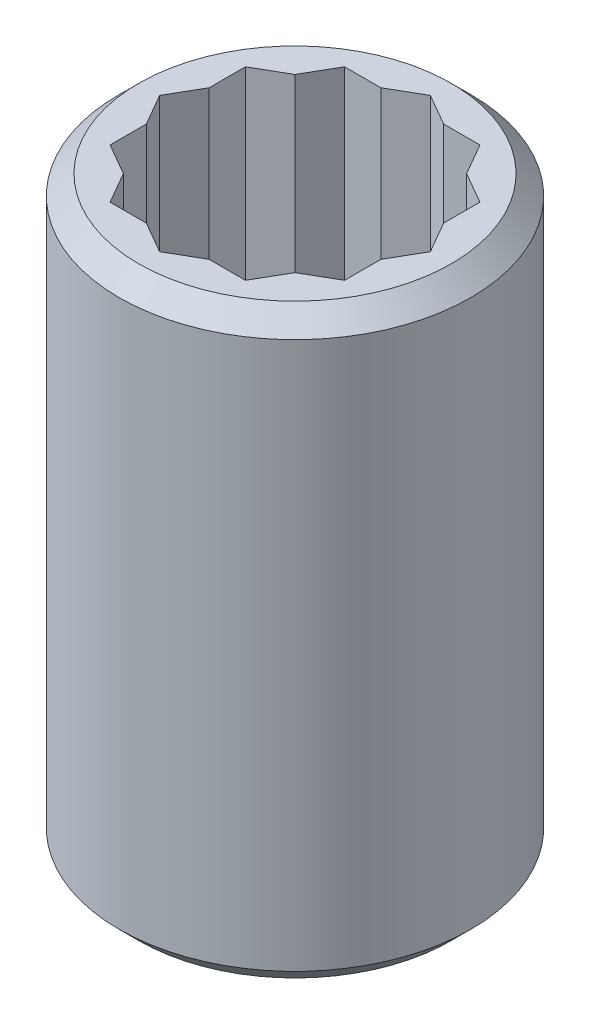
ISO-10303-21;
HEADER;
FILE_DESCRIPTION(('STEP AP214'),'2;1');
FILE_NAME('part.step','',(''),(''),'','','');
FILE_SCHEMA(('AUTOMOTIVE_DESIGN { 1 0 10303 214 1 1 1 1 }'));
ENDSEC;
DATA;
#1=APPLICATION_CONTEXT('core data for automotive mechanical design processes');
#2=APPLICATION_PROTOCOL_DEFINITION('international standard','automotive_design',2000,#1);
#3=PRODUCT_CONTEXT('',#1,'mechanical');
#4=PRODUCT('Part','Part','',(#3));
#5=PRODUCT_RELATED_PRODUCT_CATEGORY('part','',(#4));
#6=PRODUCT_DEFINITION_FORMATION('','',#4);
#7=PRODUCT_DEFINITION_CONTEXT('part definition',#1,'design');
#8=PRODUCT_DEFINITION('design','',#6,#7);
#9=PRODUCT_DEFINITION_SHAPE('','',#8);
#10=(LENGTH_UNIT() NAMED_UNIT(*) SI_UNIT(.MILLI.,.METRE.));
#11=(NAMED_UNIT(*) PLANE_ANGLE_UNIT() SI_UNIT($,.RADIAN.));
#12=(NAMED_UNIT(*) SI_UNIT($,.STERADIAN.) SOLID_ANGLE_UNIT());
#13=UNCERTAINTY_MEASURE_WITH_UNIT(LENGTH_MEASURE(1.E-05),#10,'distance_accuracy_value','');
#14=(GEOMETRIC_REPRESENTATION_CONTEXT(3) GLOBAL_UNCERTAINTY_ASSIGNED_CONTEXT((#13)) GLOBAL_UNIT_ASSIGNED_CONTEXT((#10,
#11,#12)) REPRESENTATION_CONTEXT('',''));
#15=CARTESIAN_POINT('',(0.,0.,0.));
#16=DIRECTION('',(0.,0.,1.));
#17=DIRECTION('',(1.,0.,0.));
#18=AXIS2_PLACEMENT_3D('',#15,#16,#17);
#19=CARTESIAN_POINT('',(3.46410161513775,15.,6.));
#20=DIRECTION('',(0.866025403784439,0.,0.5));
#21=DIRECTION('',(0.5,0.,-0.866025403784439));
#22=AXIS2_PLACEMENT_3D('',#19,#20,#21);
#23=PLANE('',#22);
#24=DIRECTION('',(0.5,0.,-0.866025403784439));
#25=VECTOR('',#24,1.);
#26=CARTESIAN_POINT('',(3.46410161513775,15.,6.));
#27=LINE('',#26,#25);
#28=CARTESIAN_POINT('',(6.,15.,1.60769515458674));
#29=VERTEX_POINT('',#28);
#30=CARTESIAN_POINT('',(6.92820323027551,15.,0.));
#31=VERTEX_POINT('',#30);
#32=EDGE_CURVE('E346',#29,#31,#27,.T.);
#33=ORIENTED_EDGE('',*,*,#32,.F.);
#34=DIRECTION('',(0.,1.,0.));
#35=VECTOR('',#34,1.);
#36=CARTESIAN_POINT('',(6.,15.,1.60769515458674));
#37=LINE('',#36,#35);
#38=CARTESIAN_POINT('',(6.,29.9999999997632,1.60769515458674));
#39=VERTEX_POINT('',#38);
#40=EDGE_CURVE('E338',#29,#39,#37,.T.);
#41=ORIENTED_EDGE('',*,*,#40,.T.);
#42=DIRECTION('',(0.5,0.,-0.866025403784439));
#43=VECTOR('',#42,1.);
#44=CARTESIAN_POINT('',(3.46410161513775,30.,6.));
#45=LINE('',#44,#43);
#46=CARTESIAN_POINT('',(6.92820323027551,30.,0.));
#47=VERTEX_POINT('',#46);
#48=EDGE_CURVE('E341',#39,#47,#45,.T.);
#49=ORIENTED_EDGE('',*,*,#48,.T.);
#50=DIRECTION('',(0.,1.,0.));
#51=VECTOR('',#50,1.);
#52=CARTESIAN_POINT('',(6.92820323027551,15.,0.));
#53=LINE('',#52,#51);
#54=EDGE_CURVE('E366',#31,#47,#53,.T.);
#55=ORIENTED_EDGE('',*,*,#54,.F.);
#56=EDGE_LOOP('',(#33,#41,#49,#55));
#57=FACE_BOUND('',#56,.T.);
#58=ADVANCED_FACE('F32',(#57),#23,.F.);
#59=CARTESIAN_POINT('',(-3.46410161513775,15.,6.));
#60=DIRECTION('',(0.,0.,1.));
#61=DIRECTION('',(1.,0.,0.));
#62=AXIS2_PLACEMENT_3D('',#59,#60,#61);
#63=PLANE('',#62);
#64=DIRECTION('',(1.,0.,0.));
#65=VECTOR('',#64,1.);
#66=CARTESIAN_POINT('',(-3.46410161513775,15.,6.));
#67=LINE('',#66,#65);
#68=CARTESIAN_POINT('',(1.60769515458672,15.,6.00000000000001));
#69=VERTEX_POINT('',#68);
#70=CARTESIAN_POINT('',(3.46410161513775,15.,6.));
#71=VERTEX_POINT('',#70);
#72=EDGE_CURVE('E362',#69,#71,#67,.T.);
#73=ORIENTED_EDGE('',*,*,#72,.F.);
#74=DIRECTION('',(0.,1.,0.));
#75=VECTOR('',#74,1.);
#76=CARTESIAN_POINT('',(1.60769515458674,15.,6.));
#77=LINE('',#76,#75);
#78=CARTESIAN_POINT('',(1.60769515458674,29.9999999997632,6.));
#79=VERTEX_POINT('',#78);
#80=EDGE_CURVE('E329',#69,#79,#77,.T.);
#81=ORIENTED_EDGE('',*,*,#80,.T.);
#82=DIRECTION('',(1.,0.,0.));
#83=VECTOR('',#82,1.);
#84=CARTESIAN_POINT('',(-3.46410161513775,30.,6.));
#85=LINE('',#84,#83);
#86=CARTESIAN_POINT('',(3.46410161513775,30.,6.));
#87=VERTEX_POINT('',#86);
#88=EDGE_CURVE('E386',#79,#87,#85,.T.);
#89=ORIENTED_EDGE('',*,*,#88,.T.);
#90=DIRECTION('',(0.,1.,0.));
#91=VECTOR('',#90,1.);
#92=CARTESIAN_POINT('',(3.46410161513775,15.,6.));
#93=LINE('',#92,#91);
#94=EDGE_CURVE('E390',#71,#87,#93,.T.);
#95=ORIENTED_EDGE('',*,*,#94,.F.);
#96=EDGE_LOOP('',(#73,#81,#89,#95));
#97=FACE_BOUND('',#96,.T.);
#98=ADVANCED_FACE('F464',(#97),#63,.F.);
#99=CARTESIAN_POINT('',(-6.92820323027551,15.,0.));
#100=DIRECTION('',(-0.866025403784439,0.,0.5));
#101=DIRECTION('',(0.5,0.,0.866025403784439));
#102=AXIS2_PLACEMENT_3D('',#99,#100,#101);
#103=PLANE('',#102);
#104=DIRECTION('',(0.5,0.,0.866025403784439));
#105=VECTOR('',#104,1.);
#106=CARTESIAN_POINT('',(-6.92820323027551,15.,0.));
#107=LINE('',#106,#105);
#108=CARTESIAN_POINT('',(-4.39230484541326,15.,4.39230484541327));
#109=VERTEX_POINT('',#108);
#110=CARTESIAN_POINT('',(-3.46410161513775,15.,6.));
#111=VERTEX_POINT('',#110);
#112=EDGE_CURVE('E358',#109,#111,#107,.T.);
#113=ORIENTED_EDGE('',*,*,#112,.F.);
#114=DIRECTION('',(0.,1.,0.));
#115=VECTOR('',#114,1.);
#116=CARTESIAN_POINT('',(-4.39230484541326,15.,4.39230484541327));
#117=LINE('',#116,#115);
#118=CARTESIAN_POINT('',(-4.39230484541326,29.9999999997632,4.39230484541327));
#119=VERTEX_POINT('',#118);
#120=EDGE_CURVE('E323',#109,#119,#117,.T.);
#121=ORIENTED_EDGE('',*,*,#120,.T.);
#122=DIRECTION('',(0.5,0.,0.866025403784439));
#123=VECTOR('',#122,1.);
#124=CARTESIAN_POINT('',(-6.92820323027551,30.,0.));
#125=LINE('',#124,#123);
#126=CARTESIAN_POINT('',(-3.46410161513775,30.,6.));
#127=VERTEX_POINT('',#126);
#128=EDGE_CURVE('E382',#119,#127,#125,.T.);
#129=ORIENTED_EDGE('',*,*,#128,.T.);
#130=DIRECTION('',(0.,1.,0.));
#131=VECTOR('',#130,1.);
#132=CARTESIAN_POINT('',(-3.46410161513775,15.,6.));
#133=LINE('',#132,#131);
#134=EDGE_CURVE('E394',#111,#127,#133,.T.);
#135=ORIENTED_EDGE('',*,*,#134,.F.);
#136=EDGE_LOOP('',(#113,#121,#129,#135));
#137=FACE_BOUND('',#136,.T.);
#138=ADVANCED_FACE('F480',(#137),#103,.F.);
#139=CARTESIAN_POINT('',(-3.46410161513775,15.,-6.));
#140=DIRECTION('',(-0.866025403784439,0.,-0.5));
#141=DIRECTION('',(-0.5,0.,0.866025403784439));
#142=AXIS2_PLACEMENT_3D('',#139,#140,#141);
#143=PLANE('',#142);
#144=DIRECTION('',(-0.5,0.,0.866025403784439));
#145=VECTOR('',#144,1.);
#146=CARTESIAN_POINT('',(-3.46410161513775,15.,-6.));
#147=LINE('',#146,#145);
#148=CARTESIAN_POINT('',(-6.,15.,-1.60769515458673));
#149=VERTEX_POINT('',#148);
#150=CARTESIAN_POINT('',(-6.92820323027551,15.,0.));
#151=VERTEX_POINT('',#150);
#152=EDGE_CURVE('E354',#149,#151,#147,.T.);
#153=ORIENTED_EDGE('',*,*,#152,.F.);
#154=DIRECTION('',(0.,1.,0.));
#155=VECTOR('',#154,1.);
#156=CARTESIAN_POINT('',(-6.,15.,-1.60769515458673));
#157=LINE('',#156,#155);
#158=CARTESIAN_POINT('',(-6.,29.9999999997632,-1.60769515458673));
#159=VERTEX_POINT('',#158);
#160=EDGE_CURVE('E317',#149,#159,#157,.T.);
#161=ORIENTED_EDGE('',*,*,#160,.T.);
#162=DIRECTION('',(-0.5,0.,0.866025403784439));
#163=VECTOR('',#162,1.);
#164=CARTESIAN_POINT('',(-3.46410161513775,30.,-6.));
#165=LINE('',#164,#163);
#166=CARTESIAN_POINT('',(-6.92820323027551,30.,0.));
#167=VERTEX_POINT('',#166);
#168=EDGE_CURVE('E378',#159,#167,#165,.T.);
#169=ORIENTED_EDGE('',*,*,#168,.T.);
#170=DIRECTION('',(0.,1.,0.));
#171=VECTOR('',#170,1.);
#172=CARTESIAN_POINT('',(-6.92820323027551,15.,0.));
#173=LINE('',#172,#171);
#174=EDGE_CURVE('E397',#151,#167,#173,.T.);
#175=ORIENTED_EDGE('',*,*,#174,.F.);
#176=EDGE_LOOP('',(#153,#161,#169,#175));
#177=FACE_BOUND('',#176,.T.);
#178=ADVANCED_FACE('F499',(#177),#143,.F.);
#179=CARTESIAN_POINT('',(3.46410161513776,15.,-6.));
#180=DIRECTION('',(0.,0.,-1.));
#181=DIRECTION('',(-1.,0.,0.));
#182=AXIS2_PLACEMENT_3D('',#179,#180,#181);
#183=PLANE('',#182);
#184=DIRECTION('',(-1.,0.,0.));
#185=VECTOR('',#184,1.);
#186=CARTESIAN_POINT('',(3.46410161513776,15.,-6.));
#187=LINE('',#186,#185);
#188=CARTESIAN_POINT('',(-1.60769515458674,15.,-6.));
#189=VERTEX_POINT('',#188);
#190=CARTESIAN_POINT('',(-3.46410161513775,15.,-6.));
#191=VERTEX_POINT('',#190);
#192=EDGE_CURVE('E350',#189,#191,#187,.T.);
#193=ORIENTED_EDGE('',*,*,#192,.F.);
#194=DIRECTION('',(0.,1.,0.));
#195=VECTOR('',#194,1.);
#196=CARTESIAN_POINT('',(-1.60769515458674,15.,-6.));
#197=LINE('',#196,#195);
#198=CARTESIAN_POINT('',(-1.60769515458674,29.9999999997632,-6.));
#199=VERTEX_POINT('',#198);
#200=EDGE_CURVE('E311',#189,#199,#197,.T.);
#201=ORIENTED_EDGE('',*,*,#200,.T.);
#202=DIRECTION('',(-1.,0.,0.));
#203=VECTOR('',#202,1.);
#204=CARTESIAN_POINT('',(3.46410161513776,30.,-6.));
#205=LINE('',#204,#203);
#206=CARTESIAN_POINT('',(-3.46410161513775,30.,-6.));
#207=VERTEX_POINT('',#206);
#208=EDGE_CURVE('E374',#199,#207,#205,.T.);
#209=ORIENTED_EDGE('',*,*,#208,.T.);
#210=DIRECTION('',(0.,1.,0.));
#211=VECTOR('',#210,1.);
#212=CARTESIAN_POINT('',(-3.46410161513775,15.,-6.));
#213=LINE('',#212,#211);
#214=EDGE_CURVE('E400',#191,#207,#213,.T.);
#215=ORIENTED_EDGE('',*,*,#214,.F.);
#216=EDGE_LOOP('',(#193,#201,#209,#215));
#217=FACE_BOUND('',#216,.T.);
#218=ADVANCED_FACE('F517',(#217),#183,.F.);
#219=CARTESIAN_POINT('',(6.92820323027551,15.,0.));
#220=DIRECTION('',(0.866025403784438,0.,-0.5));
#221=DIRECTION('',(-0.5,0.,-0.866025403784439));
#222=AXIS2_PLACEMENT_3D('',#219,#220,#221);
#223=PLANE('',#222);
#224=DIRECTION('',(-0.5,0.,-0.866025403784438));
#225=VECTOR('',#224,1.);
#226=CARTESIAN_POINT('',(6.92820323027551,30.,0.));
#227=LINE('',#226,#225);
#228=CARTESIAN_POINT('',(6.,29.9999999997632,-1.60769515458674));
#229=VERTEX_POINT('',#228);
#230=EDGE_CURVE('E371',#47,#229,#227,.T.);
#231=ORIENTED_EDGE('',*,*,#230,.T.);
#232=DIRECTION('',(0.,-1.,0.));
#233=VECTOR('',#232,1.);
#234=CARTESIAN_POINT('',(6.,15.,-1.60769515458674));
#235=LINE('',#234,#233);
#236=CARTESIAN_POINT('',(6.,15.,-1.60769515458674));
#237=VERTEX_POINT('',#236);
#238=EDGE_CURVE('E335',#229,#237,#235,.T.);
#239=ORIENTED_EDGE('',*,*,#238,.T.);
#240=DIRECTION('',(-0.5,0.,-0.866025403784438));
#241=VECTOR('',#240,1.);
#242=CARTESIAN_POINT('',(6.92820323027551,15.,0.));
#243=LINE('',#242,#241);
#244=EDGE_CURVE('E347',#31,#237,#243,.T.);
#245=ORIENTED_EDGE('',*,*,#244,.F.);
#246=ORIENTED_EDGE('',*,*,#54,.T.);
#247=EDGE_LOOP('',(#231,#239,#245,#246));
#248=FACE_BOUND('',#247,.T.);
#249=ADVANCED_FACE('F427',(#248),#223,.F.);
#250=CARTESIAN_POINT('',(0.,30.,0.));
#251=DIRECTION('',(0.,-1.,0.));
#252=DIRECTION('',(0.,0.,-1.));
#253=AXIS2_PLACEMENT_3D('',#250,#251,#252);
#254=CYLINDRICAL_SURFACE('',#253,9.);
#255=CARTESIAN_POINT('',(0.,0.999999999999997,0.));
#256=DIRECTION('',(0.,1.,0.));
#257=DIRECTION('',(0.,0.,1.));
#258=AXIS2_PLACEMENT_3D('',#255,#256,#257);
#259=CIRCLE('',#258,9.);
#260=CARTESIAN_POINT('',(0.,0.999999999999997,9.));
#261=VERTEX_POINT('',#260);
#262=EDGE_CURVE('E410',#261,#261,#259,.T.);
#263=ORIENTED_EDGE('',*,*,#262,.T.);
#264=EDGE_LOOP('',(#263));
#265=FACE_BOUND('',#264,.T.);
#266=CARTESIAN_POINT('',(0.,29.,0.));
#267=DIRECTION('',(0.,1.,0.));
#268=DIRECTION('',(0.,0.,1.));
#269=AXIS2_PLACEMENT_3D('',#266,#267,#268);
#270=CIRCLE('',#269,9.);
#271=CARTESIAN_POINT('',(0.,29.,9.));
#272=VERTEX_POINT('',#271);
#273=EDGE_CURVE('E393',#272,#272,#270,.F.);
#274=ORIENTED_EDGE('',*,*,#273,.T.);
#275=EDGE_LOOP('',(#274));
#276=FACE_BOUND('',#275,.T.);
#277=ADVANCED_FACE('F423',(#265,#276),#254,.T.);
#278=CARTESIAN_POINT('',(0.,30.,0.));
#279=DIRECTION('',(0.,1.,0.));
#280=DIRECTION('',(0.,0.,1.));
#281=AXIS2_PLACEMENT_3D('',#278,#279,#280);
#282=PLANE('',#281);
#283=CARTESIAN_POINT('',(0.,30.,0.));
#284=DIRECTION('',(0.,1.,0.));
#285=DIRECTION('',(0.,0.,1.));
#286=AXIS2_PLACEMENT_3D('',#283,#284,#285);
#287=CIRCLE('',#286,8.);
#288=CARTESIAN_POINT('',(0.,30.,8.));
#289=VERTEX_POINT('',#288);
#290=EDGE_CURVE('E11',#289,#289,#287,.T.);
#291=ORIENTED_EDGE('',*,*,#290,.T.);
#292=EDGE_LOOP('',(#291));
#293=FACE_BOUND('',#292,.T.);
#294=DIRECTION('',(0.,0.,-1.));
#295=VECTOR('',#294,1.);
#296=CARTESIAN_POINT('',(6.,29.9999999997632,3.46410161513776));
#297=LINE('',#296,#295);
#298=CARTESIAN_POINT('',(6.,29.9999999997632,3.46410161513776));
#299=VERTEX_POINT('',#298);
#300=EDGE_CURVE('E268',#299,#39,#297,.T.);
#301=ORIENTED_EDGE('',*,*,#300,.F.);
#302=DIRECTION('',(0.866025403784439,0.,-0.5));
#303=VECTOR('',#302,1.);
#304=CARTESIAN_POINT('',(0.,29.9999999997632,6.92820323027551));
#305=LINE('',#304,#303);
#306=CARTESIAN_POINT('',(4.39230484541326,29.9999999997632,4.39230484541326));
#307=VERTEX_POINT('',#306);
#308=EDGE_CURVE('E282',#307,#299,#305,.T.);
#309=ORIENTED_EDGE('',*,*,#308,.F.);
#310=EDGE_CURVE('E367',#87,#307,#45,.T.);
#311=ORIENTED_EDGE('',*,*,#310,.F.);
#312=ORIENTED_EDGE('',*,*,#88,.F.);
#313=CARTESIAN_POINT('',(0.,29.9999999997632,6.92820323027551));
#314=VERTEX_POINT('',#313);
#315=EDGE_CURVE('E283',#314,#79,#305,.T.);
#316=ORIENTED_EDGE('',*,*,#315,.F.);
#317=DIRECTION('',(0.866025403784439,0.,0.5));
#318=VECTOR('',#317,1.);
#319=CARTESIAN_POINT('',(-6.,29.9999999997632,3.46410161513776));
#320=LINE('',#319,#318);
#321=CARTESIAN_POINT('',(-1.60769515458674,29.9999999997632,6.));
#322=VERTEX_POINT('',#321);
#323=EDGE_CURVE('E279',#322,#314,#320,.T.);
#324=ORIENTED_EDGE('',*,*,#323,.F.);
#325=EDGE_CURVE('E387',#127,#322,#85,.T.);
#326=ORIENTED_EDGE('',*,*,#325,.F.);
#327=ORIENTED_EDGE('',*,*,#128,.F.);
#328=CARTESIAN_POINT('',(-6.,29.9999999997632,3.46410161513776));
#329=VERTEX_POINT('',#328);
#330=EDGE_CURVE('E280',#329,#119,#320,.T.);
#331=ORIENTED_EDGE('',*,*,#330,.F.);
#332=DIRECTION('',(0.,0.,1.));
#333=VECTOR('',#332,1.);
#334=CARTESIAN_POINT('',(-6.,29.9999999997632,-3.46410161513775));
#335=LINE('',#334,#333);
#336=CARTESIAN_POINT('',(-6.,29.9999999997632,1.60769515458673));
#337=VERTEX_POINT('',#336);
#338=EDGE_CURVE('E276',#337,#329,#335,.T.);
#339=ORIENTED_EDGE('',*,*,#338,.F.);
#340=EDGE_CURVE('E383',#167,#337,#125,.T.);
#341=ORIENTED_EDGE('',*,*,#340,.F.);
#342=ORIENTED_EDGE('',*,*,#168,.F.);
#343=CARTESIAN_POINT('',(-6.,29.9999999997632,-3.46410161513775));
#344=VERTEX_POINT('',#343);
#345=EDGE_CURVE('E277',#344,#159,#335,.T.);
#346=ORIENTED_EDGE('',*,*,#345,.F.);
#347=DIRECTION('',(-0.866025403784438,0.,0.5));
#348=VECTOR('',#347,1.);
#349=CARTESIAN_POINT('',(0.,29.9999999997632,-6.92820323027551));
#350=LINE('',#349,#348);
#351=CARTESIAN_POINT('',(-4.39230484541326,29.9999999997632,-4.39230484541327));
#352=VERTEX_POINT('',#351);
#353=EDGE_CURVE('E273',#352,#344,#350,.T.);
#354=ORIENTED_EDGE('',*,*,#353,.F.);
#355=EDGE_CURVE('E379',#207,#352,#165,.T.);
#356=ORIENTED_EDGE('',*,*,#355,.F.);
#357=ORIENTED_EDGE('',*,*,#208,.F.);
#358=CARTESIAN_POINT('',(0.,29.9999999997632,-6.92820323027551));
#359=VERTEX_POINT('',#358);
#360=EDGE_CURVE('E274',#359,#199,#350,.T.);
#361=ORIENTED_EDGE('',*,*,#360,.F.);
#362=DIRECTION('',(-0.866025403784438,0.,-0.5));
#363=VECTOR('',#362,1.);
#364=CARTESIAN_POINT('',(6.,29.9999999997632,-3.46410161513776));
#365=LINE('',#364,#363);
#366=CARTESIAN_POINT('',(1.60769515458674,29.9999999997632,-6.));
#367=VERTEX_POINT('',#366);
#368=EDGE_CURVE('E270',#367,#359,#365,.T.);
#369=ORIENTED_EDGE('',*,*,#368,.F.);
#370=CARTESIAN_POINT('',(3.46410161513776,30.,-6.));
#371=VERTEX_POINT('',#370);
#372=EDGE_CURVE('E375',#371,#367,#205,.T.);
#373=ORIENTED_EDGE('',*,*,#372,.F.);
#374=CARTESIAN_POINT('',(4.39230484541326,29.9999999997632,-4.39230484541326));
#375=VERTEX_POINT('',#374);
#376=EDGE_CURVE('E370',#375,#371,#227,.T.);
#377=ORIENTED_EDGE('',*,*,#376,.F.);
#378=CARTESIAN_POINT('',(6.,29.9999999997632,-3.46410161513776));
#379=VERTEX_POINT('',#378);
#380=EDGE_CURVE('E271',#379,#375,#365,.T.);
#381=ORIENTED_EDGE('',*,*,#380,.F.);
#382=EDGE_CURVE('E223',#229,#379,#297,.T.);
#383=ORIENTED_EDGE('',*,*,#382,.F.);
#384=ORIENTED_EDGE('',*,*,#230,.F.);
#385=ORIENTED_EDGE('',*,*,#48,.F.);
#386=EDGE_LOOP('',(#301,#309,#311,#312,#316,#324,#326,#327,#331,#339,#341,#342,#346,#354,#356,
#357,#361,#369,#373,#377,#381,#383,#384,#385));
#387=FACE_BOUND('',#386,.T.);
#388=ADVANCED_FACE('F426',(#293,#387),#282,.T.);
#389=CARTESIAN_POINT('',(0.,0.,0.));
#390=DIRECTION('',(0.,1.,0.));
#391=DIRECTION('',(0.,0.,1.));
#392=AXIS2_PLACEMENT_3D('',#389,#390,#391);
#393=PLANE('',#392);
#394=CARTESIAN_POINT('',(0.,0.,0.));
#395=DIRECTION('',(0.,1.,0.));
#396=DIRECTION('',(0.,0.,1.));
#397=AXIS2_PLACEMENT_3D('',#394,#395,#396);
#398=CIRCLE('',#397,8.);
#399=CARTESIAN_POINT('',(0.,0.,8.));
#400=VERTEX_POINT('',#399);
#401=EDGE_CURVE('E40',#400,#400,#398,.F.);
#402=ORIENTED_EDGE('',*,*,#401,.T.);
#403=EDGE_LOOP('',(#402));
#404=FACE_BOUND('',#403,.T.);
#405=DIRECTION('',(1.,0.,0.));
#406=VECTOR('',#405,1.);
#407=CARTESIAN_POINT('',(-3.,0.,-3.));
#408=LINE('',#407,#406);
#409=CARTESIAN_POINT('',(-3.,0.,-3.));
#410=VERTEX_POINT('',#409);
#411=CARTESIAN_POINT('',(3.,0.,-3.));
#412=VERTEX_POINT('',#411);
#413=EDGE_CURVE('E236',#410,#412,#408,.T.);
#414=ORIENTED_EDGE('',*,*,#413,.F.);
#415=DIRECTION('',(0.,0.,-1.));
#416=VECTOR('',#415,1.);
#417=CARTESIAN_POINT('',(-3.,0.,3.));
#418=LINE('',#417,#416);
#419=CARTESIAN_POINT('',(-3.,0.,3.));
#420=VERTEX_POINT('',#419);
#421=EDGE_CURVE('E47',#420,#410,#418,.T.);
#422=ORIENTED_EDGE('',*,*,#421,.F.);
#423=DIRECTION('',(-1.,0.,0.));
#424=VECTOR('',#423,1.);
#425=CARTESIAN_POINT('',(-3.,0.,3.));
#426=LINE('',#425,#424);
#427=CARTESIAN_POINT('',(3.,0.,3.));
#428=VERTEX_POINT('',#427);
#429=EDGE_CURVE('E229',#428,#420,#426,.T.);
#430=ORIENTED_EDGE('',*,*,#429,.F.);
#431=DIRECTION('',(0.,0.,1.));
#432=VECTOR('',#431,1.);
#433=CARTESIAN_POINT('',(3.,0.,3.));
#434=LINE('',#433,#432);
#435=EDGE_CURVE('E243',#412,#428,#434,.T.);
#436=ORIENTED_EDGE('',*,*,#435,.F.);
#437=EDGE_LOOP('',(#414,#422,#430,#436));
#438=FACE_BOUND('',#437,.T.);
#439=ADVANCED_FACE('F415',(#404,#438),#393,.F.);
#440=ORIENTED_EDGE('',*,*,#310,.T.);
#441=DIRECTION('',(0.,-1.,0.));
#442=VECTOR('',#441,1.);
#443=CARTESIAN_POINT('',(4.39230484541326,15.,4.39230484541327));
#444=LINE('',#443,#442);
#445=CARTESIAN_POINT('',(4.39230484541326,15.,4.39230484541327));
#446=VERTEX_POINT('',#445);
#447=EDGE_CURVE('E332',#307,#446,#444,.T.);
#448=ORIENTED_EDGE('',*,*,#447,.T.);
#449=EDGE_CURVE('E342',#71,#446,#27,.T.);
#450=ORIENTED_EDGE('',*,*,#449,.F.);
#451=ORIENTED_EDGE('',*,*,#94,.T.);
#452=EDGE_LOOP('',(#440,#448,#450,#451));
#453=FACE_BOUND('',#452,.T.);
#454=ADVANCED_FACE('F457',(#453),#23,.F.);
#455=ORIENTED_EDGE('',*,*,#325,.T.);
#456=DIRECTION('',(0.,-1.,0.));
#457=VECTOR('',#456,1.);
#458=CARTESIAN_POINT('',(-1.60769515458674,15.,6.));
#459=LINE('',#458,#457);
#460=CARTESIAN_POINT('',(-1.60769515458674,15.,6.));
#461=VERTEX_POINT('',#460);
#462=EDGE_CURVE('E326',#322,#461,#459,.T.);
#463=ORIENTED_EDGE('',*,*,#462,.T.);
#464=EDGE_CURVE('E363',#111,#461,#67,.T.);
#465=ORIENTED_EDGE('',*,*,#464,.F.);
#466=ORIENTED_EDGE('',*,*,#134,.T.);
#467=EDGE_LOOP('',(#455,#463,#465,#466));
#468=FACE_BOUND('',#467,.T.);
#469=ADVANCED_FACE('F475',(#468),#63,.F.);
#470=ORIENTED_EDGE('',*,*,#340,.T.);
#471=DIRECTION('',(0.,-1.,0.));
#472=VECTOR('',#471,1.);
#473=CARTESIAN_POINT('',(-6.,15.,1.60769515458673));
#474=LINE('',#473,#472);
#475=CARTESIAN_POINT('',(-6.,15.,1.60769515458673));
#476=VERTEX_POINT('',#475);
#477=EDGE_CURVE('E320',#337,#476,#474,.T.);
#478=ORIENTED_EDGE('',*,*,#477,.T.);
#479=EDGE_CURVE('E359',#151,#476,#107,.T.);
#480=ORIENTED_EDGE('',*,*,#479,.F.);
#481=ORIENTED_EDGE('',*,*,#174,.T.);
#482=EDGE_LOOP('',(#470,#478,#480,#481));
#483=FACE_BOUND('',#482,.T.);
#484=ADVANCED_FACE('F493',(#483),#103,.F.);
#485=ORIENTED_EDGE('',*,*,#355,.T.);
#486=DIRECTION('',(0.,-1.,0.));
#487=VECTOR('',#486,1.);
#488=CARTESIAN_POINT('',(-4.39230484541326,15.,-4.39230484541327));
#489=LINE('',#488,#487);
#490=CARTESIAN_POINT('',(-4.39230484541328,15.,-4.39230484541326));
#491=VERTEX_POINT('',#490);
#492=EDGE_CURVE('E314',#352,#491,#489,.T.);
#493=ORIENTED_EDGE('',*,*,#492,.T.);
#494=EDGE_CURVE('E355',#191,#491,#147,.T.);
#495=ORIENTED_EDGE('',*,*,#494,.F.);
#496=ORIENTED_EDGE('',*,*,#214,.T.);
#497=EDGE_LOOP('',(#485,#493,#495,#496));
#498=FACE_BOUND('',#497,.T.);
#499=ADVANCED_FACE('F511',(#498),#143,.F.);
#500=ORIENTED_EDGE('',*,*,#372,.T.);
#501=DIRECTION('',(0.,-1.,0.));
#502=VECTOR('',#501,1.);
#503=CARTESIAN_POINT('',(1.60769515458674,15.,-6.));
#504=LINE('',#503,#502);
#505=CARTESIAN_POINT('',(1.60769515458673,15.,-6.));
#506=VERTEX_POINT('',#505);
#507=EDGE_CURVE('E308',#367,#506,#504,.T.);
#508=ORIENTED_EDGE('',*,*,#507,.T.);
#509=CARTESIAN_POINT('',(3.46410161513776,15.,-6.));
#510=VERTEX_POINT('',#509);
#511=EDGE_CURVE('E351',#510,#506,#187,.T.);
#512=ORIENTED_EDGE('',*,*,#511,.F.);
#513=DIRECTION('',(0.,1.,0.));
#514=VECTOR('',#513,1.);
#515=CARTESIAN_POINT('',(3.46410161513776,15.,-6.));
#516=LINE('',#515,#514);
#517=EDGE_CURVE('E403',#510,#371,#516,.T.);
#518=ORIENTED_EDGE('',*,*,#517,.T.);
#519=EDGE_LOOP('',(#500,#508,#512,#518));
#520=FACE_BOUND('',#519,.T.);
#521=ADVANCED_FACE('F531',(#520),#183,.F.);
#522=CARTESIAN_POINT('',(4.39230484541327,15.,-4.39230484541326));
#523=VERTEX_POINT('',#522);
#524=EDGE_CURVE('E345',#523,#510,#243,.T.);
#525=ORIENTED_EDGE('',*,*,#524,.F.);
#526=DIRECTION('',(0.,1.,0.));
#527=VECTOR('',#526,1.);
#528=CARTESIAN_POINT('',(4.39230484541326,15.,-4.39230484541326));
#529=LINE('',#528,#527);
#530=EDGE_CURVE('E305',#523,#375,#529,.T.);
#531=ORIENTED_EDGE('',*,*,#530,.T.);
#532=ORIENTED_EDGE('',*,*,#376,.T.);
#533=ORIENTED_EDGE('',*,*,#517,.F.);
#534=EDGE_LOOP('',(#525,#531,#532,#533));
#535=FACE_BOUND('',#534,.T.);
#536=ADVANCED_FACE('F536',(#535),#223,.F.);
#537=CARTESIAN_POINT('',(10.3923048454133,15.,-6.));
#538=DIRECTION('',(0.,1.,0.));
#539=DIRECTION('',(0.,0.,1.));
#540=AXIS2_PLACEMENT_3D('',#537,#538,#539);
#541=PLANE('',#540);
#542=DIRECTION('',(0.,0.,-1.));
#543=VECTOR('',#542,1.);
#544=CARTESIAN_POINT('',(-3.,15.,3.));
#545=LINE('',#544,#543);
#546=CARTESIAN_POINT('',(-3.,15.,3.));
#547=VERTEX_POINT('',#546);
#548=CARTESIAN_POINT('',(-3.,15.,-3.));
#549=VERTEX_POINT('',#548);
#550=EDGE_CURVE('E227',#547,#549,#545,.T.);
#551=ORIENTED_EDGE('',*,*,#550,.T.);
#552=DIRECTION('',(1.,0.,0.));
#553=VECTOR('',#552,1.);
#554=CARTESIAN_POINT('',(-3.,15.,-3.));
#555=LINE('',#554,#553);
#556=CARTESIAN_POINT('',(3.,15.,-3.));
#557=VERTEX_POINT('',#556);
#558=EDGE_CURVE('E216',#549,#557,#555,.T.);
#559=ORIENTED_EDGE('',*,*,#558,.T.);
#560=DIRECTION('',(0.,0.,1.));
#561=VECTOR('',#560,1.);
#562=CARTESIAN_POINT('',(3.,15.,3.));
#563=LINE('',#562,#561);
#564=CARTESIAN_POINT('',(3.,15.,3.));
#565=VERTEX_POINT('',#564);
#566=EDGE_CURVE('E238',#557,#565,#563,.T.);
#567=ORIENTED_EDGE('',*,*,#566,.T.);
#568=DIRECTION('',(-1.,0.,0.));
#569=VECTOR('',#568,1.);
#570=CARTESIAN_POINT('',(-3.,15.,3.));
#571=LINE('',#570,#569);
#572=EDGE_CURVE('E234',#565,#547,#571,.T.);
#573=ORIENTED_EDGE('',*,*,#572,.T.);
#574=EDGE_LOOP('',(#551,#559,#567,#573));
#575=FACE_BOUND('',#574,.T.);
#576=ORIENTED_EDGE('',*,*,#511,.T.);
#577=DIRECTION('',(0.866025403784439,0.,0.5));
#578=VECTOR('',#577,1.);
#579=CARTESIAN_POINT('',(6.,15.,-3.46410161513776));
#580=LINE('',#579,#578);
#581=CARTESIAN_POINT('',(0.,15.,-6.92820323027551));
#582=VERTEX_POINT('',#581);
#583=EDGE_CURVE('E303',#582,#506,#580,.T.);
#584=ORIENTED_EDGE('',*,*,#583,.F.);
#585=DIRECTION('',(0.866025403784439,0.,-0.5));
#586=VECTOR('',#585,1.);
#587=CARTESIAN_POINT('',(0.,15.,-6.92820323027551));
#588=LINE('',#587,#586);
#589=EDGE_CURVE('E255',#189,#582,#588,.T.);
#590=ORIENTED_EDGE('',*,*,#589,.F.);
#591=ORIENTED_EDGE('',*,*,#192,.T.);
#592=ORIENTED_EDGE('',*,*,#494,.T.);
#593=CARTESIAN_POINT('',(-6.,15.,-3.46410161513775));
#594=VERTEX_POINT('',#593);
#595=EDGE_CURVE('E252',#594,#491,#588,.T.);
#596=ORIENTED_EDGE('',*,*,#595,.F.);
#597=DIRECTION('',(0.,0.,-1.));
#598=VECTOR('',#597,1.);
#599=CARTESIAN_POINT('',(-6.,15.,-3.46410161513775));
#600=LINE('',#599,#598);
#601=EDGE_CURVE('E254',#149,#594,#600,.T.);
#602=ORIENTED_EDGE('',*,*,#601,.F.);
#603=ORIENTED_EDGE('',*,*,#152,.T.);
#604=ORIENTED_EDGE('',*,*,#479,.T.);
#605=CARTESIAN_POINT('',(-6.,15.,3.46410161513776));
#606=VERTEX_POINT('',#605);
#607=EDGE_CURVE('E256',#606,#476,#600,.T.);
#608=ORIENTED_EDGE('',*,*,#607,.F.);
#609=DIRECTION('',(-0.866025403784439,0.,-0.5));
#610=VECTOR('',#609,1.);
#611=CARTESIAN_POINT('',(-6.,15.,3.46410161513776));
#612=LINE('',#611,#610);
#613=EDGE_CURVE('E258',#109,#606,#612,.T.);
#614=ORIENTED_EDGE('',*,*,#613,.F.);
#615=ORIENTED_EDGE('',*,*,#112,.T.);
#616=ORIENTED_EDGE('',*,*,#464,.T.);
#617=CARTESIAN_POINT('',(0.,15.,6.92820323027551));
#618=VERTEX_POINT('',#617);
#619=EDGE_CURVE('E259',#618,#461,#612,.T.);
#620=ORIENTED_EDGE('',*,*,#619,.F.);
#621=DIRECTION('',(-0.866025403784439,0.,0.5));
#622=VECTOR('',#621,1.);
#623=CARTESIAN_POINT('',(0.,15.,6.92820323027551));
#624=LINE('',#623,#622);
#625=EDGE_CURVE('E261',#69,#618,#624,.T.);
#626=ORIENTED_EDGE('',*,*,#625,.F.);
#627=ORIENTED_EDGE('',*,*,#72,.T.);
#628=ORIENTED_EDGE('',*,*,#449,.T.);
#629=CARTESIAN_POINT('',(6.,15.,3.46410161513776));
#630=VERTEX_POINT('',#629);
#631=EDGE_CURVE('E262',#630,#446,#624,.T.);
#632=ORIENTED_EDGE('',*,*,#631,.F.);
#633=DIRECTION('',(0.,0.,1.));
#634=VECTOR('',#633,1.);
#635=CARTESIAN_POINT('',(6.,15.,3.46410161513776));
#636=LINE('',#635,#634);
#637=EDGE_CURVE('E264',#29,#630,#636,.T.);
#638=ORIENTED_EDGE('',*,*,#637,.F.);
#639=ORIENTED_EDGE('',*,*,#32,.T.);
#640=ORIENTED_EDGE('',*,*,#244,.T.);
#641=CARTESIAN_POINT('',(6.,15.,-3.46410161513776));
#642=VERTEX_POINT('',#641);
#643=EDGE_CURVE('E265',#642,#237,#636,.T.);
#644=ORIENTED_EDGE('',*,*,#643,.F.);
#645=EDGE_CURVE('E267',#523,#642,#580,.T.);
#646=ORIENTED_EDGE('',*,*,#645,.F.);
#647=ORIENTED_EDGE('',*,*,#524,.T.);
#648=EDGE_LOOP('',(#576,#584,#590,#591,#592,#596,#602,#603,#604,#608,#614,#615,#616,#620,#626,
#627,#628,#632,#638,#639,#640,#644,#646,#647));
#649=FACE_BOUND('',#648,.T.);
#650=ADVANCED_FACE('F232',(#575,#649),#541,.T.);
#651=CARTESIAN_POINT('',(6.,-3.33030277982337,-3.46410161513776));
#652=DIRECTION('',(0.5,0.,-0.866025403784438));
#653=DIRECTION('',(-0.866025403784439,0.,-0.5));
#654=AXIS2_PLACEMENT_3D('',#651,#652,#653);
#655=PLANE('',#654);
#656=ORIENTED_EDGE('',*,*,#645,.T.);
#657=DIRECTION('',(0.,1.,0.));
#658=VECTOR('',#657,1.);
#659=CARTESIAN_POINT('',(6.,-3.33030277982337,-3.46410161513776));
#660=LINE('',#659,#658);
#661=EDGE_CURVE('E285',#642,#379,#660,.T.);
#662=ORIENTED_EDGE('',*,*,#661,.T.);
#663=ORIENTED_EDGE('',*,*,#380,.T.);
#664=ORIENTED_EDGE('',*,*,#530,.F.);
#665=EDGE_LOOP('',(#656,#662,#663,#664));
#666=FACE_BOUND('',#665,.T.);
#667=ADVANCED_FACE('F539',(#666),#655,.F.);
#668=CARTESIAN_POINT('',(6.,-3.33030277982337,3.46410161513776));
#669=DIRECTION('',(1.,0.,0.));
#670=DIRECTION('',(0.,0.,-1.));
#671=AXIS2_PLACEMENT_3D('',#668,#669,#670);
#672=PLANE('',#671);
#673=ORIENTED_EDGE('',*,*,#382,.T.);
#674=ORIENTED_EDGE('',*,*,#661,.F.);
#675=ORIENTED_EDGE('',*,*,#643,.T.);
#676=ORIENTED_EDGE('',*,*,#238,.F.);
#677=EDGE_LOOP('',(#673,#674,#675,#676));
#678=FACE_BOUND('',#677,.T.);
#679=ADVANCED_FACE('F542',(#678),#672,.F.);
#680=ORIENTED_EDGE('',*,*,#368,.T.);
#681=DIRECTION('',(0.,1.,0.));
#682=VECTOR('',#681,1.);
#683=CARTESIAN_POINT('',(0.,-3.33030277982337,-6.92820323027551));
#684=LINE('',#683,#682);
#685=EDGE_CURVE('E298',#582,#359,#684,.T.);
#686=ORIENTED_EDGE('',*,*,#685,.F.);
#687=ORIENTED_EDGE('',*,*,#583,.T.);
#688=ORIENTED_EDGE('',*,*,#507,.F.);
#689=EDGE_LOOP('',(#680,#686,#687,#688));
#690=FACE_BOUND('',#689,.T.);
#691=ADVANCED_FACE('F526',(#690),#655,.F.);
#692=CARTESIAN_POINT('',(0.,-3.33030277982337,-6.92820323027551));
#693=DIRECTION('',(-0.5,0.,-0.866025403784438));
#694=DIRECTION('',(-0.866025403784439,0.,0.5));
#695=AXIS2_PLACEMENT_3D('',#692,#693,#694);
#696=PLANE('',#695);
#697=ORIENTED_EDGE('',*,*,#589,.T.);
#698=ORIENTED_EDGE('',*,*,#685,.T.);
#699=ORIENTED_EDGE('',*,*,#360,.T.);
#700=ORIENTED_EDGE('',*,*,#200,.F.);
#701=EDGE_LOOP('',(#697,#698,#699,#700));
#702=FACE_BOUND('',#701,.T.);
#703=ADVANCED_FACE('F523',(#702),#696,.F.);
#704=ORIENTED_EDGE('',*,*,#353,.T.);
#705=DIRECTION('',(0.,1.,0.));
#706=VECTOR('',#705,1.);
#707=CARTESIAN_POINT('',(-6.,-3.33030277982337,-3.46410161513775));
#708=LINE('',#707,#706);
#709=EDGE_CURVE('E295',#594,#344,#708,.T.);
#710=ORIENTED_EDGE('',*,*,#709,.F.);
#711=ORIENTED_EDGE('',*,*,#595,.T.);
#712=ORIENTED_EDGE('',*,*,#492,.F.);
#713=EDGE_LOOP('',(#704,#710,#711,#712));
#714=FACE_BOUND('',#713,.T.);
#715=ADVANCED_FACE('F508',(#714),#696,.F.);
#716=CARTESIAN_POINT('',(-6.,-3.33030277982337,-3.46410161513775));
#717=DIRECTION('',(-1.,0.,0.));
#718=DIRECTION('',(0.,0.,1.));
#719=AXIS2_PLACEMENT_3D('',#716,#717,#718);
#720=PLANE('',#719);
#721=ORIENTED_EDGE('',*,*,#601,.T.);
#722=ORIENTED_EDGE('',*,*,#709,.T.);
#723=ORIENTED_EDGE('',*,*,#345,.T.);
#724=ORIENTED_EDGE('',*,*,#160,.F.);
#725=EDGE_LOOP('',(#721,#722,#723,#724));
#726=FACE_BOUND('',#725,.T.);
#727=ADVANCED_FACE('F505',(#726),#720,.F.);
#728=ORIENTED_EDGE('',*,*,#338,.T.);
#729=DIRECTION('',(0.,1.,0.));
#730=VECTOR('',#729,1.);
#731=CARTESIAN_POINT('',(-6.,-3.33030277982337,3.46410161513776));
#732=LINE('',#731,#730);
#733=EDGE_CURVE('E292',#606,#329,#732,.T.);
#734=ORIENTED_EDGE('',*,*,#733,.F.);
#735=ORIENTED_EDGE('',*,*,#607,.T.);
#736=ORIENTED_EDGE('',*,*,#477,.F.);
#737=EDGE_LOOP('',(#728,#734,#735,#736));
#738=FACE_BOUND('',#737,.T.);
#739=ADVANCED_FACE('F490',(#738),#720,.F.);
#740=CARTESIAN_POINT('',(-6.,-3.33030277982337,3.46410161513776));
#741=DIRECTION('',(-0.5,0.,0.866025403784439));
#742=DIRECTION('',(0.866025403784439,0.,0.5));
#743=AXIS2_PLACEMENT_3D('',#740,#741,#742);
#744=PLANE('',#743);
#745=ORIENTED_EDGE('',*,*,#613,.T.);
#746=ORIENTED_EDGE('',*,*,#733,.T.);
#747=ORIENTED_EDGE('',*,*,#330,.T.);
#748=ORIENTED_EDGE('',*,*,#120,.F.);
#749=EDGE_LOOP('',(#745,#746,#747,#748));
#750=FACE_BOUND('',#749,.T.);
#751=ADVANCED_FACE('F486',(#750),#744,.F.);
#752=ORIENTED_EDGE('',*,*,#323,.T.);
#753=DIRECTION('',(0.,1.,0.));
#754=VECTOR('',#753,1.);
#755=CARTESIAN_POINT('',(0.,-3.33030277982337,6.92820323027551));
#756=LINE('',#755,#754);
#757=EDGE_CURVE('E289',#618,#314,#756,.T.);
#758=ORIENTED_EDGE('',*,*,#757,.F.);
#759=ORIENTED_EDGE('',*,*,#619,.T.);
#760=ORIENTED_EDGE('',*,*,#462,.F.);
#761=EDGE_LOOP('',(#752,#758,#759,#760));
#762=FACE_BOUND('',#761,.T.);
#763=ADVANCED_FACE('F471',(#762),#744,.F.);
#764=CARTESIAN_POINT('',(0.,-3.33030277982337,6.92820323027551));
#765=DIRECTION('',(0.5,0.,0.866025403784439));
#766=DIRECTION('',(0.866025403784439,0.,-0.5));
#767=AXIS2_PLACEMENT_3D('',#764,#765,#766);
#768=PLANE('',#767);
#769=ORIENTED_EDGE('',*,*,#625,.T.);
#770=ORIENTED_EDGE('',*,*,#757,.T.);
#771=ORIENTED_EDGE('',*,*,#315,.T.);
#772=ORIENTED_EDGE('',*,*,#80,.F.);
#773=EDGE_LOOP('',(#769,#770,#771,#772));
#774=FACE_BOUND('',#773,.T.);
#775=ADVANCED_FACE('F467',(#774),#768,.F.);
#776=ORIENTED_EDGE('',*,*,#637,.T.);
#777=DIRECTION('',(0.,1.,0.));
#778=VECTOR('',#777,1.);
#779=CARTESIAN_POINT('',(6.,-3.33030277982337,3.46410161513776));
#780=LINE('',#779,#778);
#781=EDGE_CURVE('E286',#630,#299,#780,.T.);
#782=ORIENTED_EDGE('',*,*,#781,.T.);
#783=ORIENTED_EDGE('',*,*,#300,.T.);
#784=ORIENTED_EDGE('',*,*,#40,.F.);
#785=EDGE_LOOP('',(#776,#782,#783,#784));
#786=FACE_BOUND('',#785,.T.);
#787=ADVANCED_FACE('F445',(#786),#672,.F.);
#788=ORIENTED_EDGE('',*,*,#308,.T.);
#789=ORIENTED_EDGE('',*,*,#781,.F.);
#790=ORIENTED_EDGE('',*,*,#631,.T.);
#791=ORIENTED_EDGE('',*,*,#447,.F.);
#792=EDGE_LOOP('',(#788,#789,#790,#791));
#793=FACE_BOUND('',#792,.T.);
#794=ADVANCED_FACE('F455',(#793),#768,.F.);
#795=CARTESIAN_POINT('',(-3.,30.001,3.));
#796=DIRECTION('',(-1.,0.,0.));
#797=DIRECTION('',(0.,0.,1.));
#798=AXIS2_PLACEMENT_3D('',#795,#796,#797);
#799=PLANE('',#798);
#800=DIRECTION('',(0.,-1.,0.));
#801=VECTOR('',#800,1.);
#802=CARTESIAN_POINT('',(-3.,30.001,3.));
#803=LINE('',#802,#801);
#804=EDGE_CURVE('E224',#547,#420,#803,.T.);
#805=ORIENTED_EDGE('',*,*,#804,.T.);
#806=ORIENTED_EDGE('',*,*,#421,.T.);
#807=DIRECTION('',(0.,-1.,0.));
#808=VECTOR('',#807,1.);
#809=CARTESIAN_POINT('',(-3.,30.001,-3.));
#810=LINE('',#809,#808);
#811=EDGE_CURVE('E218',#549,#410,#810,.T.);
#812=ORIENTED_EDGE('',*,*,#811,.F.);
#813=ORIENTED_EDGE('',*,*,#550,.F.);
#814=EDGE_LOOP('',(#805,#806,#812,#813));
#815=FACE_BOUND('',#814,.T.);
#816=ADVANCED_FACE('F226',(#815),#799,.F.);
#817=CARTESIAN_POINT('',(-3.,30.001,3.));
#818=DIRECTION('',(0.,0.,1.));
#819=DIRECTION('',(1.,0.,0.));
#820=AXIS2_PLACEMENT_3D('',#817,#818,#819);
#821=PLANE('',#820);
#822=DIRECTION('',(0.,-1.,0.));
#823=VECTOR('',#822,1.);
#824=CARTESIAN_POINT('',(3.,30.001,3.));
#825=LINE('',#824,#823);
#826=EDGE_CURVE('E249',#565,#428,#825,.T.);
#827=ORIENTED_EDGE('',*,*,#826,.T.);
#828=ORIENTED_EDGE('',*,*,#429,.T.);
#829=ORIENTED_EDGE('',*,*,#804,.F.);
#830=ORIENTED_EDGE('',*,*,#572,.F.);
#831=EDGE_LOOP('',(#827,#828,#829,#830));
#832=FACE_BOUND('',#831,.T.);
#833=ADVANCED_FACE('F593',(#832),#821,.F.);
#834=CARTESIAN_POINT('',(3.,30.001,3.));
#835=DIRECTION('',(1.,0.,0.));
#836=DIRECTION('',(0.,0.,-1.));
#837=AXIS2_PLACEMENT_3D('',#834,#835,#836);
#838=PLANE('',#837);
#839=DIRECTION('',(0.,-1.,0.));
#840=VECTOR('',#839,1.);
#841=CARTESIAN_POINT('',(3.,30.001,-3.));
#842=LINE('',#841,#840);
#843=EDGE_CURVE('E55',#557,#412,#842,.T.);
#844=ORIENTED_EDGE('',*,*,#843,.T.);
#845=ORIENTED_EDGE('',*,*,#435,.T.);
#846=ORIENTED_EDGE('',*,*,#826,.F.);
#847=ORIENTED_EDGE('',*,*,#566,.F.);
#848=EDGE_LOOP('',(#844,#845,#846,#847));
#849=FACE_BOUND('',#848,.T.);
#850=ADVANCED_FACE('F583',(#849),#838,.F.);
#851=CARTESIAN_POINT('',(-3.,30.001,-3.));
#852=DIRECTION('',(0.,0.,-1.));
#853=DIRECTION('',(-1.,0.,0.));
#854=AXIS2_PLACEMENT_3D('',#851,#852,#853);
#855=PLANE('',#854);
#856=ORIENTED_EDGE('',*,*,#811,.T.);
#857=ORIENTED_EDGE('',*,*,#413,.T.);
#858=ORIENTED_EDGE('',*,*,#843,.F.);
#859=ORIENTED_EDGE('',*,*,#558,.F.);
#860=EDGE_LOOP('',(#856,#857,#858,#859));
#861=FACE_BOUND('',#860,.T.);
#862=ADVANCED_FACE('F217',(#861),#855,.F.);
#863=CARTESIAN_POINT('',(0.,0.999999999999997,0.));
#864=DIRECTION('',(0.,1.,0.));
#865=DIRECTION('',(0.,0.,1.));
#866=AXIS2_PLACEMENT_3D('',#863,#864,#865);
#867=CONICAL_SURFACE('',#866,9.,0.78539816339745);
#868=ORIENTED_EDGE('',*,*,#401,.F.);
#869=EDGE_LOOP('',(#868));
#870=FACE_BOUND('',#869,.T.);
#871=ORIENTED_EDGE('',*,*,#262,.F.);
#872=EDGE_LOOP('',(#871));
#873=FACE_BOUND('',#872,.T.);
#874=ADVANCED_FACE('F418',(#870,#873),#867,.T.);
#875=CARTESIAN_POINT('',(0.,30.,0.));
#876=DIRECTION('',(0.,-1.,0.));
#877=DIRECTION('',(0.,0.,-1.));
#878=AXIS2_PLACEMENT_3D('',#875,#876,#877);
#879=CONICAL_SURFACE('',#878,8.,0.785398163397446);
#880=ORIENTED_EDGE('',*,*,#273,.F.);
#881=EDGE_LOOP('',(#880));
#882=FACE_BOUND('',#881,.T.);
#883=ORIENTED_EDGE('',*,*,#290,.F.);
#884=EDGE_LOOP('',(#883));
#885=FACE_BOUND('',#884,.T.);
#886=ADVANCED_FACE('F34',(#882,#885),#879,.T.);
#887=CLOSED_SHELL('',(#58,#98,#138,#178,#218,#249,#277,#388,#439,#454,#469,#484,#499,#521,#536,
#650,#667,#679,#691,#703,#715,#727,#739,#751,#763,#775,#787,#794,#816,#833,#850,#862,#874,#886));
#888=MANIFOLD_SOLID_BREP('B2',#887);
#889=ADVANCED_BREP_SHAPE_REPRESENTATION('',(#18,#888),#14);
#890=SHAPE_DEFINITION_REPRESENTATION(#9,#889);
ENDSEC;
END-ISO-10303-21;
